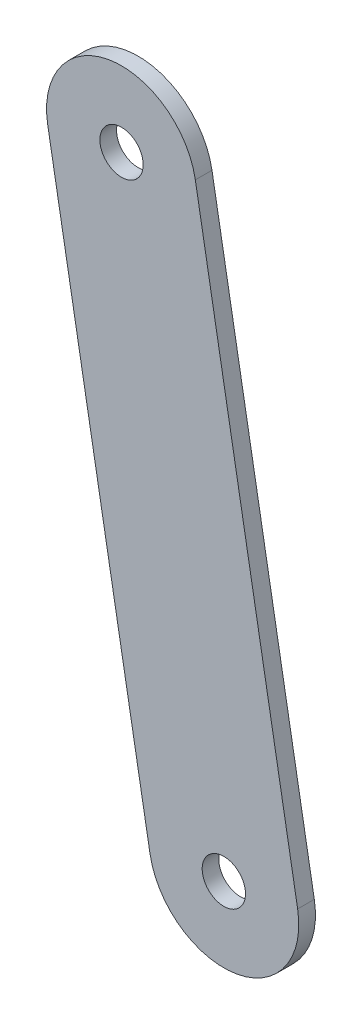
ISO-10303-21;
HEADER;
FILE_DESCRIPTION(('STEP AP214'),'2;1');
FILE_NAME('part.step','',(''),(''),'','','');
FILE_SCHEMA(('AUTOMOTIVE_DESIGN { 1 0 10303 214 1 1 1 1 }'));
ENDSEC;
DATA;
#1=APPLICATION_CONTEXT('core data for automotive mechanical design processes');
#2=APPLICATION_PROTOCOL_DEFINITION('international standard','automotive_design',2000,#1);
#3=PRODUCT_CONTEXT('',#1,'mechanical');
#4=PRODUCT('Part','Part','',(#3));
#5=PRODUCT_RELATED_PRODUCT_CATEGORY('part','',(#4));
#6=PRODUCT_DEFINITION_FORMATION('','',#4);
#7=PRODUCT_DEFINITION_CONTEXT('part definition',#1,'design');
#8=PRODUCT_DEFINITION('design','',#6,#7);
#9=PRODUCT_DEFINITION_SHAPE('','',#8);
#10=(LENGTH_UNIT() NAMED_UNIT(*) SI_UNIT(.MILLI.,.METRE.));
#11=(NAMED_UNIT(*) PLANE_ANGLE_UNIT() SI_UNIT($,.RADIAN.));
#12=(NAMED_UNIT(*) SI_UNIT($,.STERADIAN.) SOLID_ANGLE_UNIT());
#13=UNCERTAINTY_MEASURE_WITH_UNIT(LENGTH_MEASURE(1.E-05),#10,'distance_accuracy_value','');
#14=(GEOMETRIC_REPRESENTATION_CONTEXT(3) GLOBAL_UNCERTAINTY_ASSIGNED_CONTEXT((#13)) GLOBAL_UNIT_ASSIGNED_CONTEXT((#10,
#11,#12)) REPRESENTATION_CONTEXT('',''));
#15=CARTESIAN_POINT('',(0.,0.,0.));
#16=DIRECTION('',(0.,0.,1.));
#17=DIRECTION('',(1.,0.,0.));
#18=AXIS2_PLACEMENT_3D('',#15,#16,#17);
#19=CARTESIAN_POINT('',(-22.,-68.,-2.4));
#20=DIRECTION('',(0.,0.,1.));
#21=DIRECTION('',(1.,0.,0.));
#22=AXIS2_PLACEMENT_3D('',#19,#20,#21);
#23=PLANE('',#22);
#24=CARTESIAN_POINT('',(-22.,-68.,-2.4));
#25=DIRECTION('',(0.,0.,1.));
#26=DIRECTION('',(1.,0.,0.));
#27=AXIS2_PLACEMENT_3D('',#24,#25,#26);
#28=CIRCLE('',#27,2.6);
#29=CARTESIAN_POINT('',(-19.4,-68.,-2.4));
#30=VERTEX_POINT('',#29);
#31=EDGE_CURVE('E102',#30,#30,#28,.T.);
#32=ORIENTED_EDGE('',*,*,#31,.F.);
#33=EDGE_LOOP('',(#32));
#34=FACE_BOUND('',#33,.T.);
#35=CARTESIAN_POINT('',(-22.,-68.,-2.4));
#36=DIRECTION('',(0.,0.,1.));
#37=DIRECTION('',(1.,0.,0.));
#38=AXIS2_PLACEMENT_3D('',#35,#36,#37);
#39=CIRCLE('',#38,9.);
#40=CARTESIAN_POINT('',(-13.1367302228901,-66.4371664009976,-2.4));
#41=VERTEX_POINT('',#40);
#42=CARTESIAN_POINT('',(-30.8632697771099,-69.5628335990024,-2.4));
#43=VERTEX_POINT('',#42);
#44=EDGE_CURVE('E87',#41,#43,#39,.T.);
#45=ORIENTED_EDGE('',*,*,#44,.T.);
#46=DIRECTION('',(0.17364817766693,-0.984807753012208,0.));
#47=VECTOR('',#46,1.);
#48=CARTESIAN_POINT('',(-30.8632697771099,-69.5628335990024,-2.4));
#49=LINE('',#48,#47);
#50=CARTESIAN_POINT('',(-18.5776612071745,-139.237982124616,-2.4));
#51=VERTEX_POINT('',#50);
#52=EDGE_CURVE('E82',#43,#51,#49,.T.);
#53=ORIENTED_EDGE('',*,*,#52,.T.);
#54=CARTESIAN_POINT('',(-9.71439143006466,-137.675148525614,-2.4));
#55=DIRECTION('',(0.,0.,1.));
#56=DIRECTION('',(1.,0.,0.));
#57=AXIS2_PLACEMENT_3D('',#54,#55,#56);
#58=CIRCLE('',#57,9.);
#59=CARTESIAN_POINT('',(-0.851121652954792,-136.112314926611,-2.4));
#60=VERTEX_POINT('',#59);
#61=EDGE_CURVE('E85',#51,#60,#58,.T.);
#62=ORIENTED_EDGE('',*,*,#61,.T.);
#63=DIRECTION('',(-0.17364817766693,0.984807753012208,0.));
#64=VECTOR('',#63,1.);
#65=CARTESIAN_POINT('',(-0.851121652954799,-136.112314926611,-2.4));
#66=LINE('',#65,#64);
#67=EDGE_CURVE('E52',#60,#41,#66,.T.);
#68=ORIENTED_EDGE('',*,*,#67,.T.);
#69=EDGE_LOOP('',(#45,#53,#62,#68));
#70=FACE_BOUND('',#69,.T.);
#71=CARTESIAN_POINT('',(-9.71439143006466,-137.675148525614,-2.4));
#72=DIRECTION('',(0.,0.,1.));
#73=DIRECTION('',(1.,0.,0.));
#74=AXIS2_PLACEMENT_3D('',#71,#72,#73);
#75=CIRCLE('',#74,2.59999999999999);
#76=CARTESIAN_POINT('',(-7.11439143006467,-137.675148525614,-2.4));
#77=VERTEX_POINT('',#76);
#78=EDGE_CURVE('E117',#77,#77,#75,.T.);
#79=ORIENTED_EDGE('',*,*,#78,.F.);
#80=EDGE_LOOP('',(#79));
#81=FACE_BOUND('',#80,.T.);
#82=ADVANCED_FACE('F35',(#34,#70,#81),#23,.T.);
#83=CARTESIAN_POINT('',(-22.,-68.,-4.4));
#84=DIRECTION('',(0.,0.,1.));
#85=DIRECTION('',(1.,0.,0.));
#86=AXIS2_PLACEMENT_3D('',#83,#84,#85);
#87=PLANE('',#86);
#88=CARTESIAN_POINT('',(-22.,-68.,-4.4));
#89=DIRECTION('',(0.,0.,1.));
#90=DIRECTION('',(1.,0.,0.));
#91=AXIS2_PLACEMENT_3D('',#88,#89,#90);
#92=CIRCLE('',#91,9.);
#93=CARTESIAN_POINT('',(-13.1367302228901,-66.4371664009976,-4.4));
#94=VERTEX_POINT('',#93);
#95=CARTESIAN_POINT('',(-30.8632697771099,-69.5628335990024,-4.4));
#96=VERTEX_POINT('',#95);
#97=EDGE_CURVE('E99',#94,#96,#92,.T.);
#98=ORIENTED_EDGE('',*,*,#97,.F.);
#99=DIRECTION('',(-0.17364817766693,0.984807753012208,0.));
#100=VECTOR('',#99,1.);
#101=CARTESIAN_POINT('',(-0.851121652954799,-136.112314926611,-4.4));
#102=LINE('',#101,#100);
#103=CARTESIAN_POINT('',(-0.851121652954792,-136.112314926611,-4.4));
#104=VERTEX_POINT('',#103);
#105=EDGE_CURVE('E75',#104,#94,#102,.T.);
#106=ORIENTED_EDGE('',*,*,#105,.F.);
#107=CARTESIAN_POINT('',(-9.71439143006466,-137.675148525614,-4.4));
#108=DIRECTION('',(0.,0.,1.));
#109=DIRECTION('',(1.,0.,0.));
#110=AXIS2_PLACEMENT_3D('',#107,#108,#109);
#111=CIRCLE('',#110,9.);
#112=CARTESIAN_POINT('',(-18.5776612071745,-139.237982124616,-4.4));
#113=VERTEX_POINT('',#112);
#114=EDGE_CURVE('E69',#113,#104,#111,.T.);
#115=ORIENTED_EDGE('',*,*,#114,.F.);
#116=DIRECTION('',(0.17364817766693,-0.984807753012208,0.));
#117=VECTOR('',#116,1.);
#118=CARTESIAN_POINT('',(-30.8632697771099,-69.5628335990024,-4.4));
#119=LINE('',#118,#117);
#120=EDGE_CURVE('E91',#96,#113,#119,.T.);
#121=ORIENTED_EDGE('',*,*,#120,.F.);
#122=EDGE_LOOP('',(#98,#106,#115,#121));
#123=FACE_BOUND('',#122,.T.);
#124=CARTESIAN_POINT('',(-22.,-68.,-4.4));
#125=DIRECTION('',(0.,0.,1.));
#126=DIRECTION('',(1.,0.,0.));
#127=AXIS2_PLACEMENT_3D('',#124,#125,#126);
#128=CIRCLE('',#127,2.6);
#129=CARTESIAN_POINT('',(-19.4,-68.,-4.4));
#130=VERTEX_POINT('',#129);
#131=EDGE_CURVE('E114',#130,#130,#128,.T.);
#132=ORIENTED_EDGE('',*,*,#131,.T.);
#133=EDGE_LOOP('',(#132));
#134=FACE_BOUND('',#133,.T.);
#135=CARTESIAN_POINT('',(-9.71439143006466,-137.675148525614,-4.4));
#136=DIRECTION('',(0.,0.,1.));
#137=DIRECTION('',(1.,0.,0.));
#138=AXIS2_PLACEMENT_3D('',#135,#136,#137);
#139=CIRCLE('',#138,2.59999999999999);
#140=CARTESIAN_POINT('',(-7.11439143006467,-137.675148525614,-4.4));
#141=VERTEX_POINT('',#140);
#142=EDGE_CURVE('E120',#141,#141,#139,.T.);
#143=ORIENTED_EDGE('',*,*,#142,.T.);
#144=EDGE_LOOP('',(#143));
#145=FACE_BOUND('',#144,.T.);
#146=ADVANCED_FACE('F110',(#123,#134,#145),#87,.F.);
#147=CARTESIAN_POINT('',(-22.,-68.,-2.4));
#148=DIRECTION('',(0.,0.,-1.));
#149=DIRECTION('',(-1.,0.,0.));
#150=AXIS2_PLACEMENT_3D('',#147,#148,#149);
#151=CYLINDRICAL_SURFACE('',#150,9.);
#152=ORIENTED_EDGE('',*,*,#97,.T.);
#153=DIRECTION('',(0.,0.,-1.));
#154=VECTOR('',#153,1.);
#155=CARTESIAN_POINT('',(-30.8632697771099,-69.5628335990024,-2.4));
#156=LINE('',#155,#154);
#157=EDGE_CURVE('E11',#43,#96,#156,.T.);
#158=ORIENTED_EDGE('',*,*,#157,.F.);
#159=ORIENTED_EDGE('',*,*,#44,.F.);
#160=DIRECTION('',(0.,0.,-1.));
#161=VECTOR('',#160,1.);
#162=CARTESIAN_POINT('',(-13.1367302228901,-66.4371664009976,-2.4));
#163=LINE('',#162,#161);
#164=EDGE_CURVE('E95',#41,#94,#163,.T.);
#165=ORIENTED_EDGE('',*,*,#164,.T.);
#166=EDGE_LOOP('',(#152,#158,#159,#165));
#167=FACE_BOUND('',#166,.T.);
#168=ADVANCED_FACE('F37',(#167),#151,.T.);
#169=CARTESIAN_POINT('',(-30.8632697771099,-69.5628335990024,-2.4));
#170=DIRECTION('',(0.984807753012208,0.17364817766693,0.));
#171=DIRECTION('',(-0.17364817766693,0.984807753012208,0.));
#172=AXIS2_PLACEMENT_3D('',#169,#170,#171);
#173=PLANE('',#172);
#174=ORIENTED_EDGE('',*,*,#120,.T.);
#175=DIRECTION('',(0.,0.,-1.));
#176=VECTOR('',#175,1.);
#177=CARTESIAN_POINT('',(-18.5776612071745,-139.237982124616,-2.4));
#178=LINE('',#177,#176);
#179=EDGE_CURVE('E44',#51,#113,#178,.T.);
#180=ORIENTED_EDGE('',*,*,#179,.F.);
#181=ORIENTED_EDGE('',*,*,#52,.F.);
#182=ORIENTED_EDGE('',*,*,#157,.T.);
#183=EDGE_LOOP('',(#174,#180,#181,#182));
#184=FACE_BOUND('',#183,.T.);
#185=ADVANCED_FACE('F90',(#184),#173,.F.);
#186=CARTESIAN_POINT('',(-9.71439143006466,-137.675148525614,-2.4));
#187=DIRECTION('',(0.,0.,-1.));
#188=DIRECTION('',(-1.,0.,0.));
#189=AXIS2_PLACEMENT_3D('',#186,#187,#188);
#190=CYLINDRICAL_SURFACE('',#189,9.);
#191=ORIENTED_EDGE('',*,*,#114,.T.);
#192=DIRECTION('',(0.,0.,-1.));
#193=VECTOR('',#192,1.);
#194=CARTESIAN_POINT('',(-0.851121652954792,-136.112314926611,-2.4));
#195=LINE('',#194,#193);
#196=EDGE_CURVE('E92',#60,#104,#195,.T.);
#197=ORIENTED_EDGE('',*,*,#196,.F.);
#198=ORIENTED_EDGE('',*,*,#61,.F.);
#199=ORIENTED_EDGE('',*,*,#179,.T.);
#200=EDGE_LOOP('',(#191,#197,#198,#199));
#201=FACE_BOUND('',#200,.T.);
#202=ADVANCED_FACE('F93',(#201),#190,.T.);
#203=CARTESIAN_POINT('',(-0.851121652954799,-136.112314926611,-2.4));
#204=DIRECTION('',(-0.984807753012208,-0.17364817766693,0.));
#205=DIRECTION('',(0.17364817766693,-0.984807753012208,0.));
#206=AXIS2_PLACEMENT_3D('',#203,#204,#205);
#207=PLANE('',#206);
#208=ORIENTED_EDGE('',*,*,#105,.T.);
#209=ORIENTED_EDGE('',*,*,#164,.F.);
#210=ORIENTED_EDGE('',*,*,#67,.F.);
#211=ORIENTED_EDGE('',*,*,#196,.T.);
#212=EDGE_LOOP('',(#208,#209,#210,#211));
#213=FACE_BOUND('',#212,.T.);
#214=ADVANCED_FACE('F107',(#213),#207,.F.);
#215=CARTESIAN_POINT('',(-22.,-68.,-2.4));
#216=DIRECTION('',(0.,0.,-1.));
#217=DIRECTION('',(-1.,0.,0.));
#218=AXIS2_PLACEMENT_3D('',#215,#216,#217);
#219=CYLINDRICAL_SURFACE('',#218,2.6);
#220=ORIENTED_EDGE('',*,*,#31,.T.);
#221=EDGE_LOOP('',(#220));
#222=FACE_BOUND('',#221,.T.);
#223=ORIENTED_EDGE('',*,*,#131,.F.);
#224=EDGE_LOOP('',(#223));
#225=FACE_BOUND('',#224,.T.);
#226=ADVANCED_FACE('F137',(#222,#225),#219,.F.);
#227=CARTESIAN_POINT('',(-9.71439143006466,-137.675148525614,-2.4));
#228=DIRECTION('',(0.,0.,-1.));
#229=DIRECTION('',(-1.,0.,0.));
#230=AXIS2_PLACEMENT_3D('',#227,#228,#229);
#231=CYLINDRICAL_SURFACE('',#230,2.59999999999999);
#232=ORIENTED_EDGE('',*,*,#78,.T.);
#233=EDGE_LOOP('',(#232));
#234=FACE_BOUND('',#233,.T.);
#235=ORIENTED_EDGE('',*,*,#142,.F.);
#236=EDGE_LOOP('',(#235));
#237=FACE_BOUND('',#236,.T.);
#238=ADVANCED_FACE('F126',(#234,#237),#231,.F.);
#239=CLOSED_SHELL('',(#82,#146,#168,#185,#202,#214,#226,#238));
#240=MANIFOLD_SOLID_BREP('B2',#239);
#241=ADVANCED_BREP_SHAPE_REPRESENTATION('',(#18,#240),#14);
#242=SHAPE_DEFINITION_REPRESENTATION(#9,#241);
ENDSEC;
END-ISO-10303-21;
